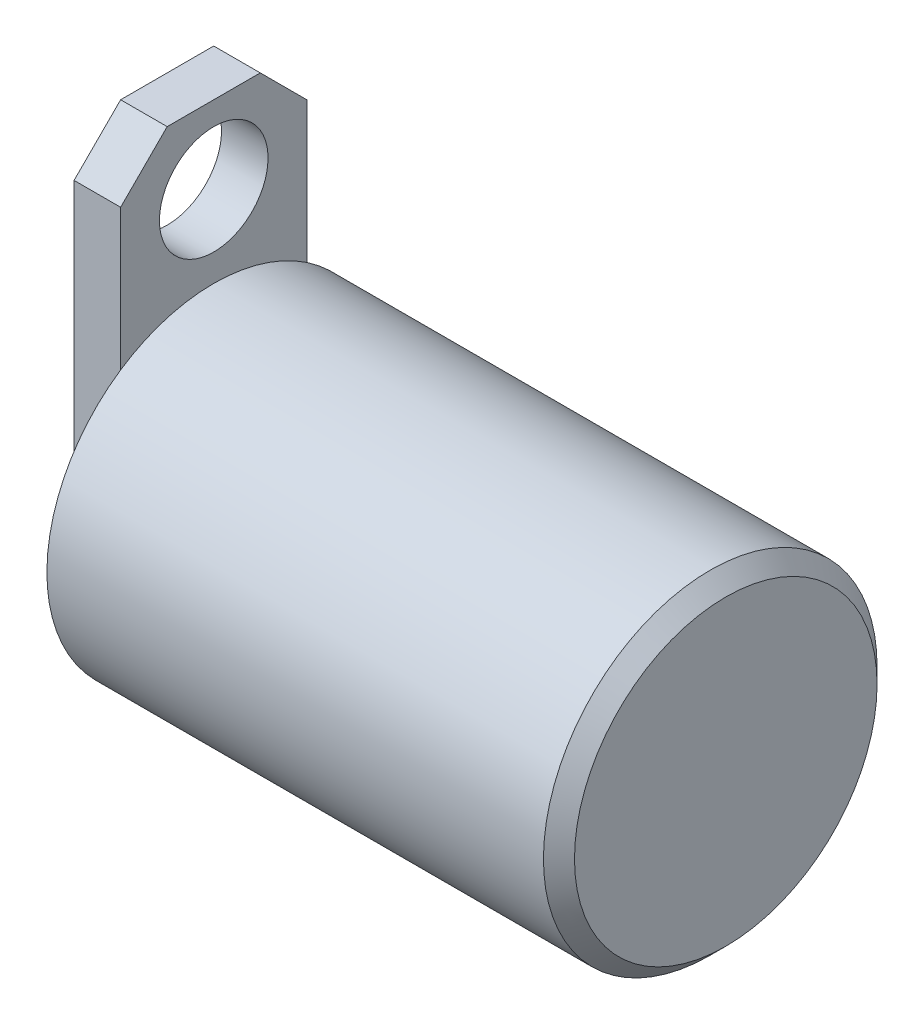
ISO-10303-21;
HEADER;
FILE_DESCRIPTION(('STEP AP214'),'2;1');
FILE_NAME('part.step','',(''),(''),'','','');
FILE_SCHEMA(('AUTOMOTIVE_DESIGN { 1 0 10303 214 1 1 1 1 }'));
ENDSEC;
DATA;
#1=APPLICATION_CONTEXT('core data for automotive mechanical design processes');
#2=APPLICATION_PROTOCOL_DEFINITION('international standard','automotive_design',2000,#1);
#3=PRODUCT_CONTEXT('',#1,'mechanical');
#4=PRODUCT('Part','Part','',(#3));
#5=PRODUCT_RELATED_PRODUCT_CATEGORY('part','',(#4));
#6=PRODUCT_DEFINITION_FORMATION('','',#4);
#7=PRODUCT_DEFINITION_CONTEXT('part definition',#1,'design');
#8=PRODUCT_DEFINITION('design','',#6,#7);
#9=PRODUCT_DEFINITION_SHAPE('','',#8);
#10=(LENGTH_UNIT() NAMED_UNIT(*) SI_UNIT(.MILLI.,.METRE.));
#11=(NAMED_UNIT(*) PLANE_ANGLE_UNIT() SI_UNIT($,.RADIAN.));
#12=(NAMED_UNIT(*) SI_UNIT($,.STERADIAN.) SOLID_ANGLE_UNIT());
#13=UNCERTAINTY_MEASURE_WITH_UNIT(LENGTH_MEASURE(1.E-05),#10,'distance_accuracy_value','');
#14=(GEOMETRIC_REPRESENTATION_CONTEXT(3) GLOBAL_UNCERTAINTY_ASSIGNED_CONTEXT((#13)) GLOBAL_UNIT_ASSIGNED_CONTEXT((#10,
#11,#12)) REPRESENTATION_CONTEXT('',''));
#15=CARTESIAN_POINT('',(0.,0.,0.));
#16=DIRECTION('',(0.,0.,1.));
#17=DIRECTION('',(1.,0.,0.));
#18=AXIS2_PLACEMENT_3D('',#15,#16,#17);
#19=CARTESIAN_POINT('',(0.,0.,0.));
#20=DIRECTION('',(1.,0.,0.));
#21=DIRECTION('',(0.,0.,-1.));
#22=AXIS2_PLACEMENT_3D('',#19,#20,#21);
#23=PLANE('',#22);
#24=DIRECTION('',(0.,-1.,0.));
#25=VECTOR('',#24,1.);
#26=CARTESIAN_POINT('',(0.,21.,-6.));
#27=LINE('',#26,#25);
#28=CARTESIAN_POINT('',(0.,8.91978138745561,-6.));
#29=VERTEX_POINT('',#28);
#30=CARTESIAN_POINT('',(0.,0.,-6.));
#31=VERTEX_POINT('',#30);
#32=EDGE_CURVE('E143',#29,#31,#27,.T.);
#33=ORIENTED_EDGE('',*,*,#32,.F.);
#34=CARTESIAN_POINT('',(0.,0.,0.));
#35=DIRECTION('',(1.,0.,0.));
#36=DIRECTION('',(0.,0.,-1.));
#37=AXIS2_PLACEMENT_3D('',#34,#35,#36);
#38=CIRCLE('',#37,10.75);
#39=CARTESIAN_POINT('',(0.,8.91978138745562,6.));
#40=VERTEX_POINT('',#39);
#41=EDGE_CURVE('E125',#40,#29,#38,.T.);
#42=ORIENTED_EDGE('',*,*,#41,.F.);
#43=DIRECTION('',(0.,1.,0.));
#44=VECTOR('',#43,1.);
#45=CARTESIAN_POINT('',(0.,0.,6.));
#46=LINE('',#45,#44);
#47=CARTESIAN_POINT('',(0.,0.,6.));
#48=VERTEX_POINT('',#47);
#49=EDGE_CURVE('E138',#48,#40,#46,.T.);
#50=ORIENTED_EDGE('',*,*,#49,.F.);
#51=DIRECTION('',(0.,0.,1.));
#52=VECTOR('',#51,1.);
#53=CARTESIAN_POINT('',(0.,0.,0.));
#54=LINE('',#53,#52);
#55=EDGE_CURVE('E123',#31,#48,#54,.T.);
#56=ORIENTED_EDGE('',*,*,#55,.F.);
#57=EDGE_LOOP('',(#33,#42,#50,#56));
#58=FACE_BOUND('',#57,.T.);
#59=ADVANCED_FACE('F43',(#58),#23,.F.);
#60=CARTESIAN_POINT('',(33.,0.,0.));
#61=DIRECTION('',(-1.,0.,0.));
#62=DIRECTION('',(0.,0.,1.));
#63=AXIS2_PLACEMENT_3D('',#60,#61,#62);
#64=CYLINDRICAL_SURFACE('',#63,10.75);
#65=CARTESIAN_POINT('',(32.,0.,0.));
#66=DIRECTION('',(1.,0.,0.));
#67=DIRECTION('',(0.,0.,-1.));
#68=AXIS2_PLACEMENT_3D('',#65,#66,#67);
#69=CIRCLE('',#68,10.75);
#70=CARTESIAN_POINT('',(32.,0.,-10.75));
#71=VERTEX_POINT('',#70);
#72=EDGE_CURVE('E11',#71,#71,#69,.F.);
#73=ORIENTED_EDGE('',*,*,#72,.T.);
#74=EDGE_LOOP('',(#73));
#75=FACE_BOUND('',#74,.T.);
#76=EDGE_CURVE('E145',#29,#40,#38,.T.);
#77=ORIENTED_EDGE('',*,*,#76,.T.);
#78=ORIENTED_EDGE('',*,*,#41,.T.);
#79=EDGE_LOOP('',(#77,#78));
#80=FACE_BOUND('',#79,.T.);
#81=ADVANCED_FACE('F177',(#75,#80),#64,.T.);
#82=CARTESIAN_POINT('',(33.,0.,0.));
#83=DIRECTION('',(1.,0.,0.));
#84=DIRECTION('',(0.,0.,-1.));
#85=AXIS2_PLACEMENT_3D('',#82,#83,#84);
#86=PLANE('',#85);
#87=CARTESIAN_POINT('',(33.,0.,0.));
#88=DIRECTION('',(1.,0.,0.));
#89=DIRECTION('',(0.,0.,-1.));
#90=AXIS2_PLACEMENT_3D('',#87,#88,#89);
#91=CIRCLE('',#90,9.74999999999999);
#92=CARTESIAN_POINT('',(33.,0.,-9.74999999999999));
#93=VERTEX_POINT('',#92);
#94=EDGE_CURVE('E52',#93,#93,#91,.T.);
#95=ORIENTED_EDGE('',*,*,#94,.T.);
#96=EDGE_LOOP('',(#95));
#97=FACE_BOUND('',#96,.T.);
#98=ADVANCED_FACE('F165',(#97),#86,.T.);
#99=CARTESIAN_POINT('',(-3.,0.,0.));
#100=DIRECTION('',(-1.,0.,0.));
#101=DIRECTION('',(0.,0.,1.));
#102=AXIS2_PLACEMENT_3D('',#99,#100,#101);
#103=PLANE('',#102);
#104=DIRECTION('',(0.,0.,-1.));
#105=VECTOR('',#104,1.);
#106=CARTESIAN_POINT('',(-3.,21.,6.));
#107=LINE('',#106,#105);
#108=CARTESIAN_POINT('',(-3.,21.,3.));
#109=VERTEX_POINT('',#108);
#110=CARTESIAN_POINT('',(-3.,21.,-2.99999999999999));
#111=VERTEX_POINT('',#110);
#112=EDGE_CURVE('E129',#109,#111,#107,.T.);
#113=ORIENTED_EDGE('',*,*,#112,.T.);
#114=DIRECTION('',(0.,0.707106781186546,0.707106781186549));
#115=VECTOR('',#114,1.);
#116=CARTESIAN_POINT('',(-3.,12.,-12.));
#117=LINE('',#116,#115);
#118=CARTESIAN_POINT('',(-3.,18.,-6.));
#119=VERTEX_POINT('',#118);
#120=EDGE_CURVE('E160',#111,#119,#117,.F.);
#121=ORIENTED_EDGE('',*,*,#120,.T.);
#122=DIRECTION('',(0.,-1.,0.));
#123=VECTOR('',#122,1.);
#124=CARTESIAN_POINT('',(-3.,21.,-6.));
#125=LINE('',#124,#123);
#126=CARTESIAN_POINT('',(-3.,0.,-6.));
#127=VERTEX_POINT('',#126);
#128=EDGE_CURVE('E113',#119,#127,#125,.T.);
#129=ORIENTED_EDGE('',*,*,#128,.T.);
#130=DIRECTION('',(0.,0.,1.));
#131=VECTOR('',#130,1.);
#132=CARTESIAN_POINT('',(-3.,0.,-6.));
#133=LINE('',#132,#131);
#134=CARTESIAN_POINT('',(-3.,0.,6.));
#135=VERTEX_POINT('',#134);
#136=EDGE_CURVE('E106',#127,#135,#133,.T.);
#137=ORIENTED_EDGE('',*,*,#136,.T.);
#138=DIRECTION('',(0.,1.,0.));
#139=VECTOR('',#138,1.);
#140=CARTESIAN_POINT('',(-3.,0.,6.));
#141=LINE('',#140,#139);
#142=CARTESIAN_POINT('',(-3.,18.,6.));
#143=VERTEX_POINT('',#142);
#144=EDGE_CURVE('E110',#135,#143,#141,.T.);
#145=ORIENTED_EDGE('',*,*,#144,.T.);
#146=DIRECTION('',(0.,-0.707106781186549,0.707106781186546));
#147=VECTOR('',#146,1.);
#148=CARTESIAN_POINT('',(-3.,12.,12.));
#149=LINE('',#148,#147);
#150=EDGE_CURVE('E158',#143,#109,#149,.F.);
#151=ORIENTED_EDGE('',*,*,#150,.T.);
#152=EDGE_LOOP('',(#113,#121,#129,#137,#145,#151));
#153=FACE_BOUND('',#152,.T.);
#154=CARTESIAN_POINT('',(-3.,16.,0.));
#155=DIRECTION('',(-1.,0.,0.));
#156=DIRECTION('',(0.,0.,1.));
#157=AXIS2_PLACEMENT_3D('',#154,#155,#156);
#158=CIRCLE('',#157,3.5);
#159=CARTESIAN_POINT('',(-3.,16.,3.5));
#160=VERTEX_POINT('',#159);
#161=EDGE_CURVE('E137',#160,#160,#158,.T.);
#162=ORIENTED_EDGE('',*,*,#161,.F.);
#163=EDGE_LOOP('',(#162));
#164=FACE_BOUND('',#163,.T.);
#165=ADVANCED_FACE('F108',(#153,#164),#103,.T.);
#166=CARTESIAN_POINT('',(0.,0.,0.));
#167=DIRECTION('',(-1.,0.,0.));
#168=DIRECTION('',(0.,0.,1.));
#169=AXIS2_PLACEMENT_3D('',#166,#167,#168);
#170=PLANE('',#169);
#171=CARTESIAN_POINT('',(0.,18.,-6.));
#172=VERTEX_POINT('',#171);
#173=EDGE_CURVE('E117',#172,#29,#27,.T.);
#174=ORIENTED_EDGE('',*,*,#173,.F.);
#175=DIRECTION('',(0.,-0.707106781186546,-0.707106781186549));
#176=VECTOR('',#175,1.);
#177=CARTESIAN_POINT('',(0.,18.,-6.));
#178=LINE('',#177,#176);
#179=CARTESIAN_POINT('',(0.,21.,-2.99999999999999));
#180=VERTEX_POINT('',#179);
#181=EDGE_CURVE('E152',#172,#180,#178,.F.);
#182=ORIENTED_EDGE('',*,*,#181,.T.);
#183=DIRECTION('',(0.,0.,-1.));
#184=VECTOR('',#183,1.);
#185=CARTESIAN_POINT('',(0.,21.,6.));
#186=LINE('',#185,#184);
#187=CARTESIAN_POINT('',(0.,21.,3.));
#188=VERTEX_POINT('',#187);
#189=EDGE_CURVE('E140',#188,#180,#186,.T.);
#190=ORIENTED_EDGE('',*,*,#189,.F.);
#191=DIRECTION('',(0.,0.707106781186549,-0.707106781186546));
#192=VECTOR('',#191,1.);
#193=CARTESIAN_POINT('',(0.,21.,3.));
#194=LINE('',#193,#192);
#195=CARTESIAN_POINT('',(0.,18.,6.));
#196=VERTEX_POINT('',#195);
#197=EDGE_CURVE('E150',#188,#196,#194,.F.);
#198=ORIENTED_EDGE('',*,*,#197,.T.);
#199=EDGE_CURVE('E136',#40,#196,#46,.T.);
#200=ORIENTED_EDGE('',*,*,#199,.F.);
#201=ORIENTED_EDGE('',*,*,#76,.F.);
#202=EDGE_LOOP('',(#174,#182,#190,#198,#200,#201));
#203=FACE_BOUND('',#202,.T.);
#204=CARTESIAN_POINT('',(0.,16.,0.));
#205=DIRECTION('',(-1.,0.,0.));
#206=DIRECTION('',(0.,0.,1.));
#207=AXIS2_PLACEMENT_3D('',#204,#205,#206);
#208=CIRCLE('',#207,3.5);
#209=CARTESIAN_POINT('',(0.,16.,3.5));
#210=VERTEX_POINT('',#209);
#211=EDGE_CURVE('E311',#210,#210,#208,.T.);
#212=ORIENTED_EDGE('',*,*,#211,.T.);
#213=EDGE_LOOP('',(#212));
#214=FACE_BOUND('',#213,.T.);
#215=ADVANCED_FACE('F217',(#203,#214),#170,.F.);
#216=CARTESIAN_POINT('',(-3.,0.,0.));
#217=DIRECTION('',(0.,1.,0.));
#218=DIRECTION('',(0.,0.,1.));
#219=AXIS2_PLACEMENT_3D('',#216,#217,#218);
#220=PLANE('',#219);
#221=ORIENTED_EDGE('',*,*,#55,.T.);
#222=DIRECTION('',(1.,0.,0.));
#223=VECTOR('',#222,1.);
#224=CARTESIAN_POINT('',(-3.,0.,6.));
#225=LINE('',#224,#223);
#226=EDGE_CURVE('E121',#135,#48,#225,.T.);
#227=ORIENTED_EDGE('',*,*,#226,.F.);
#228=ORIENTED_EDGE('',*,*,#136,.F.);
#229=DIRECTION('',(1.,0.,0.));
#230=VECTOR('',#229,1.);
#231=CARTESIAN_POINT('',(-3.,0.,-6.));
#232=LINE('',#231,#230);
#233=EDGE_CURVE('E126',#127,#31,#232,.T.);
#234=ORIENTED_EDGE('',*,*,#233,.T.);
#235=EDGE_LOOP('',(#221,#227,#228,#234));
#236=FACE_BOUND('',#235,.T.);
#237=ADVANCED_FACE('F122',(#236),#220,.F.);
#238=CARTESIAN_POINT('',(-3.,0.,6.));
#239=DIRECTION('',(0.,0.,-1.));
#240=DIRECTION('',(-1.,0.,0.));
#241=AXIS2_PLACEMENT_3D('',#238,#239,#240);
#242=PLANE('',#241);
#243=ORIENTED_EDGE('',*,*,#199,.T.);
#244=DIRECTION('',(-1.,0.,0.));
#245=VECTOR('',#244,1.);
#246=CARTESIAN_POINT('',(-3.,18.,6.));
#247=LINE('',#246,#245);
#248=EDGE_CURVE('E59',#196,#143,#247,.T.);
#249=ORIENTED_EDGE('',*,*,#248,.T.);
#250=ORIENTED_EDGE('',*,*,#144,.F.);
#251=ORIENTED_EDGE('',*,*,#226,.T.);
#252=ORIENTED_EDGE('',*,*,#49,.T.);
#253=EDGE_LOOP('',(#243,#249,#250,#251,#252));
#254=FACE_BOUND('',#253,.T.);
#255=ADVANCED_FACE('F128',(#254),#242,.F.);
#256=CARTESIAN_POINT('',(-3.,21.,6.));
#257=DIRECTION('',(0.,-1.,0.));
#258=DIRECTION('',(0.,0.,-1.));
#259=AXIS2_PLACEMENT_3D('',#256,#257,#258);
#260=PLANE('',#259);
#261=ORIENTED_EDGE('',*,*,#189,.T.);
#262=DIRECTION('',(-1.,0.,0.));
#263=VECTOR('',#262,1.);
#264=CARTESIAN_POINT('',(-3.,21.,-2.99999999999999));
#265=LINE('',#264,#263);
#266=EDGE_CURVE('E67',#180,#111,#265,.T.);
#267=ORIENTED_EDGE('',*,*,#266,.T.);
#268=ORIENTED_EDGE('',*,*,#112,.F.);
#269=DIRECTION('',(1.,0.,0.));
#270=VECTOR('',#269,1.);
#271=CARTESIAN_POINT('',(-3.,21.,3.));
#272=LINE('',#271,#270);
#273=EDGE_CURVE('E154',#109,#188,#272,.T.);
#274=ORIENTED_EDGE('',*,*,#273,.T.);
#275=EDGE_LOOP('',(#261,#267,#268,#274));
#276=FACE_BOUND('',#275,.T.);
#277=ADVANCED_FACE('F221',(#276),#260,.F.);
#278=CARTESIAN_POINT('',(-3.,21.,-6.));
#279=DIRECTION('',(0.,0.,1.));
#280=DIRECTION('',(0.,-1.,0.));
#281=AXIS2_PLACEMENT_3D('',#278,#279,#280);
#282=PLANE('',#281);
#283=ORIENTED_EDGE('',*,*,#128,.F.);
#284=DIRECTION('',(1.,0.,0.));
#285=VECTOR('',#284,1.);
#286=CARTESIAN_POINT('',(-3.,18.,-6.));
#287=LINE('',#286,#285);
#288=EDGE_CURVE('E147',#119,#172,#287,.T.);
#289=ORIENTED_EDGE('',*,*,#288,.T.);
#290=ORIENTED_EDGE('',*,*,#173,.T.);
#291=ORIENTED_EDGE('',*,*,#32,.T.);
#292=ORIENTED_EDGE('',*,*,#233,.F.);
#293=EDGE_LOOP('',(#283,#289,#290,#291,#292));
#294=FACE_BOUND('',#293,.T.);
#295=ADVANCED_FACE('F203',(#294),#282,.F.);
#296=CARTESIAN_POINT('',(-3.,16.,0.));
#297=DIRECTION('',(1.,0.,0.));
#298=DIRECTION('',(0.,0.,-1.));
#299=AXIS2_PLACEMENT_3D('',#296,#297,#298);
#300=CYLINDRICAL_SURFACE('',#299,3.5);
#301=ORIENTED_EDGE('',*,*,#161,.T.);
#302=EDGE_LOOP('',(#301));
#303=FACE_BOUND('',#302,.T.);
#304=ORIENTED_EDGE('',*,*,#211,.F.);
#305=EDGE_LOOP('',(#304));
#306=FACE_BOUND('',#305,.T.);
#307=ADVANCED_FACE('F194',(#303,#306),#300,.F.);
#308=CARTESIAN_POINT('',(-3.,18.,-6.));
#309=DIRECTION('',(0.,-0.707106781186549,0.707106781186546));
#310=DIRECTION('',(1.,0.,0.));
#311=AXIS2_PLACEMENT_3D('',#308,#309,#310);
#312=PLANE('',#311);
#313=ORIENTED_EDGE('',*,*,#120,.F.);
#314=ORIENTED_EDGE('',*,*,#266,.F.);
#315=ORIENTED_EDGE('',*,*,#181,.F.);
#316=ORIENTED_EDGE('',*,*,#288,.F.);
#317=EDGE_LOOP('',(#313,#314,#315,#316));
#318=FACE_BOUND('',#317,.T.);
#319=ADVANCED_FACE('F173',(#318),#312,.F.);
#320=CARTESIAN_POINT('',(-3.,21.,3.));
#321=DIRECTION('',(0.,-0.707106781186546,-0.707106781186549));
#322=DIRECTION('',(1.,0.,0.));
#323=AXIS2_PLACEMENT_3D('',#320,#321,#322);
#324=PLANE('',#323);
#325=ORIENTED_EDGE('',*,*,#150,.F.);
#326=ORIENTED_EDGE('',*,*,#248,.F.);
#327=ORIENTED_EDGE('',*,*,#197,.F.);
#328=ORIENTED_EDGE('',*,*,#273,.F.);
#329=EDGE_LOOP('',(#325,#326,#327,#328));
#330=FACE_BOUND('',#329,.T.);
#331=ADVANCED_FACE('F168',(#330),#324,.F.);
#332=CARTESIAN_POINT('',(33.,0.,0.));
#333=DIRECTION('',(-1.,0.,0.));
#334=DIRECTION('',(0.,0.,1.));
#335=AXIS2_PLACEMENT_3D('',#332,#333,#334);
#336=CONICAL_SURFACE('',#335,9.74999999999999,0.785398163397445);
#337=ORIENTED_EDGE('',*,*,#72,.F.);
#338=EDGE_LOOP('',(#337));
#339=FACE_BOUND('',#338,.T.);
#340=ORIENTED_EDGE('',*,*,#94,.F.);
#341=EDGE_LOOP('',(#340));
#342=FACE_BOUND('',#341,.T.);
#343=ADVANCED_FACE('F46',(#339,#342),#336,.T.);
#344=CLOSED_SHELL('',(#59,#81,#98,#165,#215,#237,#255,#277,#295,#307,#319,#331,#343));
#345=MANIFOLD_SOLID_BREP('B2',#344);
#346=ADVANCED_BREP_SHAPE_REPRESENTATION('',(#18,#345),#14);
#347=SHAPE_DEFINITION_REPRESENTATION(#9,#346);
ENDSEC;
END-ISO-10303-21;
